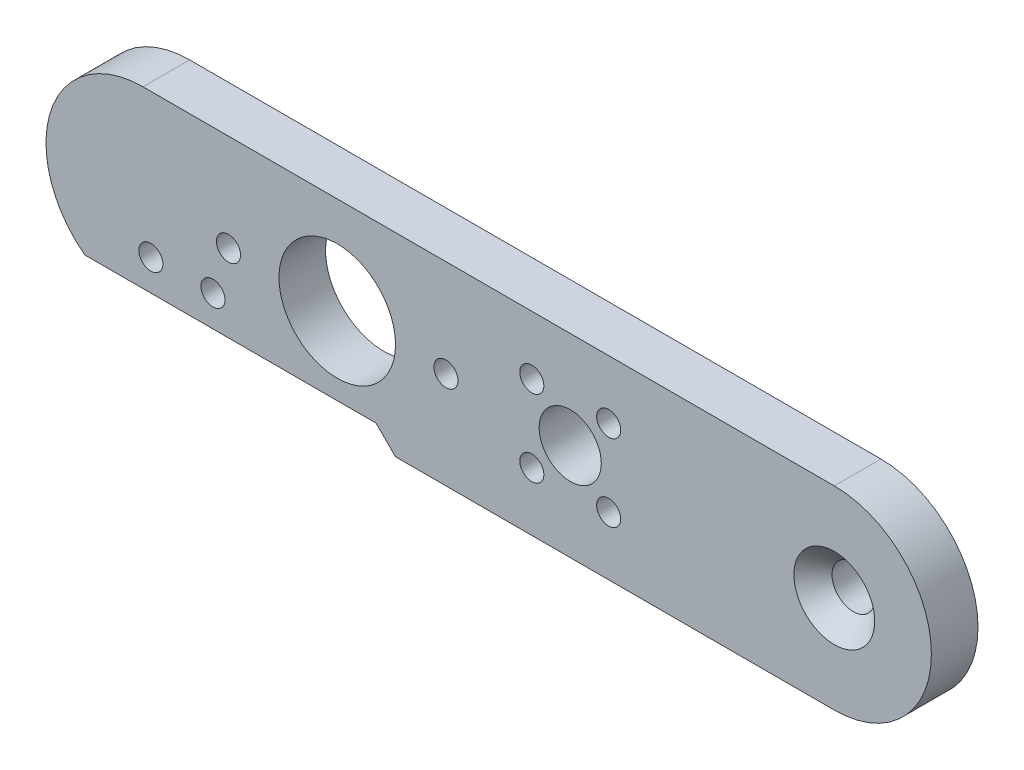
from build123d import *

# Parameters (mm, degrees)
SKETCH1_R                                       = 4
SKETCH1_R_2                                     = 1.55
SKETCH1_R_3                                     = 7.5
BOSS_EXTRUDE1_DEPTH                             = 6
CSK_FOR_M5_FLAT_HEAD_MACHINE_SCREW1_D           = 5.5
CSK_FOR_M5_FLAT_HEAD_MACHINE_SCREW1_CSINK_D     = 10.4
CSK_FOR_M5_FLAT_HEAD_MACHINE_SCREW1_CSINK_ANGLE = 90
SKETCH5_R                                       = 1.55
CUT_EXTRUDE1_DEPTH                              = 3
SKETCH6_R                                       = 3
CUT_EXTRUDE2_DEPTH                              = 59.431583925


with BuildPart() as part:
    # Sketch1 → Boss-Extrude1 (new body)
    with BuildSketch(Plane.XY):
        with BuildLine():
            Line((44.5, -12.5), (-12, -12.5))
            Line((-12, -12.5), (-14.5, -10))
            Line((-14.5, -10), (-52, -10))
            ThreePointArc((-52, -10), (-56.358541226, 3.952847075), (-44.5, 12.5))
            Line((-44.5, 12.5), (44.5, 12.5))
            ThreePointArc((44.5, 12.5), (57, 0), (44.5, -12.5))
        make_face()
        with Locations((10.5, 0)):
            Circle(SKETCH1_R, mode=Mode.SUBTRACT)
        with Locations((15.449747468, 4.949747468)):
            Circle(SKETCH1_R_2, mode=Mode.SUBTRACT)
        with Locations(Location((5.550252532, 4.949747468, 0), (0, 0, 180))):
            Circle(SKETCH1_R_2, mode=Mode.SUBTRACT)
        with Locations((15.449747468, -4.949747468)):
            Circle(SKETCH1_R_2, mode=Mode.SUBTRACT)
        with Locations(Location((5.550252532, -4.949747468, 0), (0, 0, 180))):
            Circle(SKETCH1_R_2, mode=Mode.SUBTRACT)
        with Locations((-19.5, 0)):
            Circle(SKETCH1_R_3, mode=Mode.SUBTRACT)
        with Locations((-5.5, 0)):
            Circle(SKETCH1_R_2, mode=Mode.SUBTRACT)
        with Locations((-33.5, 0)):
            Circle(SKETCH1_R_2, mode=Mode.SUBTRACT)
    extrude(amount=BOSS_EXTRUDE1_DEPTH)

    # CSK for M5 Flat Head Machine Screw1 (through all)
    with Locations(Plane.XY.offset(6)):
        with Locations((44.5, 0)):
            CounterSinkHole(CSK_FOR_M5_FLAT_HEAD_MACHINE_SCREW1_D / 2, CSK_FOR_M5_FLAT_HEAD_MACHINE_SCREW1_CSINK_D / 2, counter_sink_angle=CSK_FOR_M5_FLAT_HEAD_MACHINE_SCREW1_CSINK_ANGLE)

    # Sketch5 → Cut-Extrude1 (cut)
    with BuildSketch(Plane.XY.offset(6)):
        with Locations((-35.5, -6)):
            Circle(SKETCH5_R)
        with Locations((-43.5, -6)):
            Circle(SKETCH5_R)
    extrude(amount=-CUT_EXTRUDE1_DEPTH, mode=Mode.SUBTRACT)

    # Sketch6 → Cut-Extrude2 (cut, through all)
    with BuildSketch(Plane.XY.offset(3)):
        with Locations((-43.5, -6)):
            Circle(SKETCH6_R)
        with Locations((-35.5, -6)):
            Circle(SKETCH6_R)
    extrude(amount=-CUT_EXTRUDE2_DEPTH, mode=Mode.SUBTRACT)


solid = part.part
